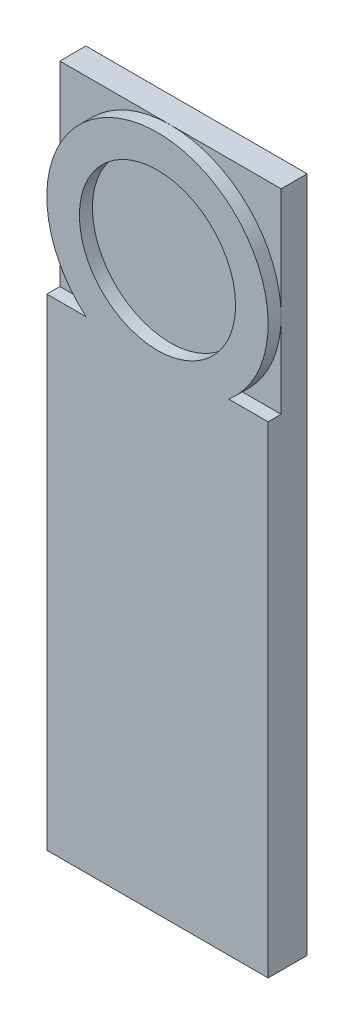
ISO-10303-21;
HEADER;
FILE_DESCRIPTION(('STEP AP214'),'2;1');
FILE_NAME('part.step','',(''),(''),'','','');
FILE_SCHEMA(('AUTOMOTIVE_DESIGN { 1 0 10303 214 1 1 1 1 }'));
ENDSEC;
DATA;
#1=APPLICATION_CONTEXT('core data for automotive mechanical design processes');
#2=APPLICATION_PROTOCOL_DEFINITION('international standard','automotive_design',2000,#1);
#3=PRODUCT_CONTEXT('',#1,'mechanical');
#4=PRODUCT('Part','Part','',(#3));
#5=PRODUCT_RELATED_PRODUCT_CATEGORY('part','',(#4));
#6=PRODUCT_DEFINITION_FORMATION('','',#4);
#7=PRODUCT_DEFINITION_CONTEXT('part definition',#1,'design');
#8=PRODUCT_DEFINITION('design','',#6,#7);
#9=PRODUCT_DEFINITION_SHAPE('','',#8);
#10=(LENGTH_UNIT() NAMED_UNIT(*) SI_UNIT(.MILLI.,.METRE.));
#11=(NAMED_UNIT(*) PLANE_ANGLE_UNIT() SI_UNIT($,.RADIAN.));
#12=(NAMED_UNIT(*) SI_UNIT($,.STERADIAN.) SOLID_ANGLE_UNIT());
#13=UNCERTAINTY_MEASURE_WITH_UNIT(LENGTH_MEASURE(1.E-05),#10,'distance_accuracy_value','');
#14=(GEOMETRIC_REPRESENTATION_CONTEXT(3) GLOBAL_UNCERTAINTY_ASSIGNED_CONTEXT((#13)) GLOBAL_UNIT_ASSIGNED_CONTEXT((#10,
#11,#12)) REPRESENTATION_CONTEXT('',''));
#15=CARTESIAN_POINT('',(0.,0.,0.));
#16=DIRECTION('',(0.,0.,1.));
#17=DIRECTION('',(1.,0.,0.));
#18=AXIS2_PLACEMENT_3D('',#15,#16,#17);
#19=CARTESIAN_POINT('',(0.,0.,4.));
#20=DIRECTION('',(0.,0.,-1.));
#21=DIRECTION('',(-1.,0.,0.));
#22=AXIS2_PLACEMENT_3D('',#19,#20,#21);
#23=CYLINDRICAL_SURFACE('',#22,12.);
#24=CARTESIAN_POINT('',(0.,0.,0.));
#25=DIRECTION('',(0.,0.,1.));
#26=DIRECTION('',(1.,0.,0.));
#27=AXIS2_PLACEMENT_3D('',#24,#25,#26);
#28=CIRCLE('',#27,12.);
#29=CARTESIAN_POINT('',(12.,0.,0.));
#30=VERTEX_POINT('',#29);
#31=EDGE_CURVE('E161',#30,#30,#28,.T.);
#32=ORIENTED_EDGE('',*,*,#31,.F.);
#33=EDGE_LOOP('',(#32));
#34=FACE_BOUND('',#33,.T.);
#35=CARTESIAN_POINT('',(0.,0.,2.));
#36=DIRECTION('',(0.,0.,1.));
#37=DIRECTION('',(1.,0.,0.));
#38=AXIS2_PLACEMENT_3D('',#35,#36,#37);
#39=CIRCLE('',#38,12.);
#40=CARTESIAN_POINT('',(12.,0.,2.));
#41=VERTEX_POINT('',#40);
#42=EDGE_CURVE('E120',#41,#41,#39,.T.);
#43=ORIENTED_EDGE('',*,*,#42,.T.);
#44=EDGE_LOOP('',(#43));
#45=FACE_BOUND('',#44,.T.);
#46=ADVANCED_FACE('F39',(#34,#45),#23,.F.);
#47=CARTESIAN_POINT('',(0.,0.,0.));
#48=DIRECTION('',(0.,0.,-1.));
#49=DIRECTION('',(-1.,0.,0.));
#50=AXIS2_PLACEMENT_3D('',#47,#48,#49);
#51=PLANE('',#50);
#52=ORIENTED_EDGE('',*,*,#31,.T.);
#53=EDGE_LOOP('',(#52));
#54=FACE_BOUND('',#53,.T.);
#55=ADVANCED_FACE('F212',(#54),#51,.F.);
#56=CARTESIAN_POINT('',(0.,0.,2.));
#57=DIRECTION('',(0.,0.,1.));
#58=DIRECTION('',(1.,0.,0.));
#59=AXIS2_PLACEMENT_3D('',#56,#57,#58);
#60=PLANE('',#59);
#61=ORIENTED_EDGE('',*,*,#42,.F.);
#62=EDGE_LOOP('',(#61));
#63=FACE_BOUND('',#62,.T.);
#64=CARTESIAN_POINT('',(0.,0.,2.));
#65=DIRECTION('',(0.,0.,1.));
#66=DIRECTION('',(1.,0.,0.));
#67=AXIS2_PLACEMENT_3D('',#64,#65,#66);
#68=CIRCLE('',#67,17.);
#69=CARTESIAN_POINT('',(10.9544511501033,-13.,2.));
#70=VERTEX_POINT('',#69);
#71=CARTESIAN_POINT('',(-10.9544511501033,-13.,2.));
#72=VERTEX_POINT('',#71);
#73=EDGE_CURVE('E112',#70,#72,#68,.T.);
#74=ORIENTED_EDGE('',*,*,#73,.T.);
#75=DIRECTION('',(-1.,0.,0.));
#76=VECTOR('',#75,1.);
#77=CARTESIAN_POINT('',(-10.9544511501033,-13.,2.));
#78=LINE('',#77,#76);
#79=CARTESIAN_POINT('',(-17.,-13.,2.));
#80=VERTEX_POINT('',#79);
#81=EDGE_CURVE('E115',#72,#80,#78,.T.);
#82=ORIENTED_EDGE('',*,*,#81,.T.);
#83=DIRECTION('',(0.,-1.,0.));
#84=VECTOR('',#83,1.);
#85=CARTESIAN_POINT('',(-17.,-13.,2.));
#86=LINE('',#85,#84);
#87=CARTESIAN_POINT('',(-17.,-87.,2.));
#88=VERTEX_POINT('',#87);
#89=EDGE_CURVE('E55',#80,#88,#86,.T.);
#90=ORIENTED_EDGE('',*,*,#89,.T.);
#91=DIRECTION('',(1.,0.,0.));
#92=VECTOR('',#91,1.);
#93=CARTESIAN_POINT('',(17.,-87.,2.));
#94=LINE('',#93,#92);
#95=CARTESIAN_POINT('',(17.,-87.,2.));
#96=VERTEX_POINT('',#95);
#97=EDGE_CURVE('E204',#88,#96,#94,.T.);
#98=ORIENTED_EDGE('',*,*,#97,.T.);
#99=DIRECTION('',(0.,1.,0.));
#100=VECTOR('',#99,1.);
#101=CARTESIAN_POINT('',(17.,-13.,2.));
#102=LINE('',#101,#100);
#103=CARTESIAN_POINT('',(17.,-13.,2.));
#104=VERTEX_POINT('',#103);
#105=EDGE_CURVE('E202',#96,#104,#102,.T.);
#106=ORIENTED_EDGE('',*,*,#105,.T.);
#107=DIRECTION('',(-1.,0.,0.));
#108=VECTOR('',#107,1.);
#109=CARTESIAN_POINT('',(10.9544511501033,-13.,2.));
#110=LINE('',#109,#108);
#111=EDGE_CURVE('E117',#104,#70,#110,.T.);
#112=ORIENTED_EDGE('',*,*,#111,.T.);
#113=EDGE_LOOP('',(#74,#82,#90,#98,#106,#112));
#114=FACE_BOUND('',#113,.T.);
#115=ADVANCED_FACE('F114',(#63,#114),#60,.T.);
#116=CARTESIAN_POINT('',(0.,0.,0.));
#117=DIRECTION('',(0.,0.,1.));
#118=DIRECTION('',(1.,0.,0.));
#119=AXIS2_PLACEMENT_3D('',#116,#117,#118);
#120=CIRCLE('',#119,17.);
#121=CARTESIAN_POINT('',(17.,0.,0.));
#122=VERTEX_POINT('',#121);
#123=CARTESIAN_POINT('',(0.,17.,0.));
#124=VERTEX_POINT('',#123);
#125=EDGE_CURVE('E11',#122,#124,#120,.T.);
#126=ORIENTED_EDGE('',*,*,#125,.F.);
#127=DIRECTION('',(0.,-1.,0.));
#128=VECTOR('',#127,1.);
#129=CARTESIAN_POINT('',(17.,0.,0.));
#130=LINE('',#129,#128);
#131=CARTESIAN_POINT('',(17.,17.,0.));
#132=VERTEX_POINT('',#131);
#133=EDGE_CURVE('E153',#132,#122,#130,.T.);
#134=ORIENTED_EDGE('',*,*,#133,.F.);
#135=DIRECTION('',(-1.,0.,0.));
#136=VECTOR('',#135,1.);
#137=CARTESIAN_POINT('',(0.,17.,0.));
#138=LINE('',#137,#136);
#139=EDGE_CURVE('E136',#132,#124,#138,.T.);
#140=ORIENTED_EDGE('',*,*,#139,.T.);
#141=EDGE_LOOP('',(#126,#134,#140));
#142=FACE_BOUND('',#141,.T.);
#143=ADVANCED_FACE('F175',(#142),#51,.F.);
#144=CARTESIAN_POINT('',(0.,17.,-4.));
#145=DIRECTION('',(0.,1.,0.));
#146=DIRECTION('',(0.,0.,1.));
#147=AXIS2_PLACEMENT_3D('',#144,#145,#146);
#148=PLANE('',#147);
#149=ORIENTED_EDGE('',*,*,#139,.F.);
#150=DIRECTION('',(0.,0.,1.));
#151=VECTOR('',#150,1.);
#152=CARTESIAN_POINT('',(17.,17.,-4.));
#153=LINE('',#152,#151);
#154=CARTESIAN_POINT('',(17.,17.,-4.));
#155=VERTEX_POINT('',#154);
#156=EDGE_CURVE('E160',#155,#132,#153,.T.);
#157=ORIENTED_EDGE('',*,*,#156,.F.);
#158=DIRECTION('',(-1.,0.,0.));
#159=VECTOR('',#158,1.);
#160=CARTESIAN_POINT('',(0.,17.,-4.));
#161=LINE('',#160,#159);
#162=CARTESIAN_POINT('',(-17.,17.,-4.));
#163=VERTEX_POINT('',#162);
#164=EDGE_CURVE('E141',#155,#163,#161,.T.);
#165=ORIENTED_EDGE('',*,*,#164,.T.);
#166=DIRECTION('',(0.,0.,1.));
#167=VECTOR('',#166,1.);
#168=CARTESIAN_POINT('',(-17.,17.,-4.));
#169=LINE('',#168,#167);
#170=CARTESIAN_POINT('',(-17.,17.,0.));
#171=VERTEX_POINT('',#170);
#172=EDGE_CURVE('E149',#163,#171,#169,.T.);
#173=ORIENTED_EDGE('',*,*,#172,.T.);
#174=EDGE_CURVE('E133',#124,#171,#138,.T.);
#175=ORIENTED_EDGE('',*,*,#174,.F.);
#176=EDGE_LOOP('',(#149,#157,#165,#173,#175));
#177=FACE_BOUND('',#176,.T.);
#178=ADVANCED_FACE('F172',(#177),#148,.T.);
#179=CARTESIAN_POINT('',(-17.,0.,0.));
#180=VERTEX_POINT('',#179);
#181=EDGE_CURVE('E47',#124,#180,#120,.T.);
#182=ORIENTED_EDGE('',*,*,#181,.F.);
#183=ORIENTED_EDGE('',*,*,#174,.T.);
#184=DIRECTION('',(0.,-1.,0.));
#185=VECTOR('',#184,1.);
#186=CARTESIAN_POINT('',(-17.,0.,0.));
#187=LINE('',#186,#185);
#188=EDGE_CURVE('E145',#171,#180,#187,.T.);
#189=ORIENTED_EDGE('',*,*,#188,.T.);
#190=EDGE_LOOP('',(#182,#183,#189));
#191=FACE_BOUND('',#190,.T.);
#192=ADVANCED_FACE('F168',(#191),#51,.F.);
#193=DIRECTION('',(-1.,0.,0.));
#194=VECTOR('',#193,1.);
#195=CARTESIAN_POINT('',(0.,-13.,0.));
#196=LINE('',#195,#194);
#197=CARTESIAN_POINT('',(-10.9544511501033,-13.,0.));
#198=VERTEX_POINT('',#197);
#199=CARTESIAN_POINT('',(-17.,-13.,0.));
#200=VERTEX_POINT('',#199);
#201=EDGE_CURVE('E189',#198,#200,#196,.T.);
#202=ORIENTED_EDGE('',*,*,#201,.F.);
#203=EDGE_CURVE('E132',#180,#198,#120,.T.);
#204=ORIENTED_EDGE('',*,*,#203,.F.);
#205=EDGE_CURVE('E155',#180,#200,#187,.T.);
#206=ORIENTED_EDGE('',*,*,#205,.T.);
#207=EDGE_LOOP('',(#202,#204,#206));
#208=FACE_BOUND('',#207,.T.);
#209=ADVANCED_FACE('F219',(#208),#51,.F.);
#210=CARTESIAN_POINT('',(17.,-13.,0.));
#211=VERTEX_POINT('',#210);
#212=CARTESIAN_POINT('',(10.9544511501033,-13.,0.));
#213=VERTEX_POINT('',#212);
#214=EDGE_CURVE('E186',#211,#213,#196,.T.);
#215=ORIENTED_EDGE('',*,*,#214,.F.);
#216=EDGE_CURVE('E152',#122,#211,#130,.T.);
#217=ORIENTED_EDGE('',*,*,#216,.F.);
#218=EDGE_CURVE('E48',#213,#122,#120,.T.);
#219=ORIENTED_EDGE('',*,*,#218,.F.);
#220=EDGE_LOOP('',(#215,#217,#219));
#221=FACE_BOUND('',#220,.T.);
#222=ADVANCED_FACE('F185',(#221),#51,.F.);
#223=CARTESIAN_POINT('',(0.,0.,-4.));
#224=DIRECTION('',(0.,0.,-1.));
#225=DIRECTION('',(-1.,0.,0.));
#226=AXIS2_PLACEMENT_3D('',#223,#224,#225);
#227=PLANE('',#226);
#228=ORIENTED_EDGE('',*,*,#164,.F.);
#229=DIRECTION('',(0.,-1.,0.));
#230=VECTOR('',#229,1.);
#231=CARTESIAN_POINT('',(17.,0.,-4.));
#232=LINE('',#231,#230);
#233=CARTESIAN_POINT('',(17.,-87.,-4.));
#234=VERTEX_POINT('',#233);
#235=EDGE_CURVE('E144',#155,#234,#232,.T.);
#236=ORIENTED_EDGE('',*,*,#235,.T.);
#237=DIRECTION('',(1.,0.,0.));
#238=VECTOR('',#237,1.);
#239=CARTESIAN_POINT('',(17.,-87.,-4.));
#240=LINE('',#239,#238);
#241=CARTESIAN_POINT('',(-17.,-87.,-4.));
#242=VERTEX_POINT('',#241);
#243=EDGE_CURVE('E198',#242,#234,#240,.T.);
#244=ORIENTED_EDGE('',*,*,#243,.F.);
#245=DIRECTION('',(0.,-1.,0.));
#246=VECTOR('',#245,1.);
#247=CARTESIAN_POINT('',(-17.,0.,-4.));
#248=LINE('',#247,#246);
#249=EDGE_CURVE('E147',#163,#242,#248,.T.);
#250=ORIENTED_EDGE('',*,*,#249,.F.);
#251=EDGE_LOOP('',(#228,#236,#244,#250));
#252=FACE_BOUND('',#251,.T.);
#253=ADVANCED_FACE('F237',(#252),#227,.T.);
#254=CARTESIAN_POINT('',(0.,-13.,0.));
#255=DIRECTION('',(0.,-1.,0.));
#256=DIRECTION('',(0.,0.,-1.));
#257=AXIS2_PLACEMENT_3D('',#254,#255,#256);
#258=PLANE('',#257);
#259=ORIENTED_EDGE('',*,*,#111,.F.);
#260=DIRECTION('',(0.,0.,1.));
#261=VECTOR('',#260,1.);
#262=CARTESIAN_POINT('',(17.,-13.,0.));
#263=LINE('',#262,#261);
#264=EDGE_CURVE('E188',#211,#104,#263,.T.);
#265=ORIENTED_EDGE('',*,*,#264,.F.);
#266=ORIENTED_EDGE('',*,*,#214,.T.);
#267=DIRECTION('',(0.,0.,-1.));
#268=VECTOR('',#267,1.);
#269=CARTESIAN_POINT('',(10.9544511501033,-13.,4.));
#270=LINE('',#269,#268);
#271=EDGE_CURVE('E134',#213,#70,#270,.F.);
#272=ORIENTED_EDGE('',*,*,#271,.T.);
#273=EDGE_LOOP('',(#259,#265,#266,#272));
#274=FACE_BOUND('',#273,.T.);
#275=ADVANCED_FACE('F240',(#274),#258,.F.);
#276=ORIENTED_EDGE('',*,*,#81,.F.);
#277=DIRECTION('',(0.,0.,-1.));
#278=VECTOR('',#277,1.);
#279=CARTESIAN_POINT('',(-10.9544511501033,-13.,4.));
#280=LINE('',#279,#278);
#281=EDGE_CURVE('E125',#72,#198,#280,.T.);
#282=ORIENTED_EDGE('',*,*,#281,.T.);
#283=ORIENTED_EDGE('',*,*,#201,.T.);
#284=DIRECTION('',(0.,0.,1.));
#285=VECTOR('',#284,1.);
#286=CARTESIAN_POINT('',(-17.,-13.,0.));
#287=LINE('',#286,#285);
#288=EDGE_CURVE('E128',#200,#80,#287,.T.);
#289=ORIENTED_EDGE('',*,*,#288,.T.);
#290=EDGE_LOOP('',(#276,#282,#283,#289));
#291=FACE_BOUND('',#290,.T.);
#292=ADVANCED_FACE('F124',(#291),#258,.F.);
#293=CARTESIAN_POINT('',(0.,-87.,0.));
#294=DIRECTION('',(0.,1.,0.));
#295=DIRECTION('',(0.,0.,1.));
#296=AXIS2_PLACEMENT_3D('',#293,#294,#295);
#297=PLANE('',#296);
#298=ORIENTED_EDGE('',*,*,#97,.F.);
#299=DIRECTION('',(0.,0.,-1.));
#300=VECTOR('',#299,1.);
#301=CARTESIAN_POINT('',(-17.,-87.,-4.));
#302=LINE('',#301,#300);
#303=EDGE_CURVE('E192',#88,#242,#302,.T.);
#304=ORIENTED_EDGE('',*,*,#303,.T.);
#305=ORIENTED_EDGE('',*,*,#243,.T.);
#306=DIRECTION('',(0.,0.,1.));
#307=VECTOR('',#306,1.);
#308=CARTESIAN_POINT('',(17.,-87.,-4.));
#309=LINE('',#308,#307);
#310=EDGE_CURVE('E195',#234,#96,#309,.T.);
#311=ORIENTED_EDGE('',*,*,#310,.T.);
#312=EDGE_LOOP('',(#298,#304,#305,#311));
#313=FACE_BOUND('',#312,.T.);
#314=ADVANCED_FACE('F232',(#313),#297,.F.);
#315=CARTESIAN_POINT('',(-17.,0.,-4.));
#316=DIRECTION('',(-1.,0.,0.));
#317=DIRECTION('',(0.,0.,1.));
#318=AXIS2_PLACEMENT_3D('',#315,#316,#317);
#319=PLANE('',#318);
#320=ORIENTED_EDGE('',*,*,#303,.F.);
#321=ORIENTED_EDGE('',*,*,#89,.F.);
#322=ORIENTED_EDGE('',*,*,#288,.F.);
#323=ORIENTED_EDGE('',*,*,#205,.F.);
#324=ORIENTED_EDGE('',*,*,#188,.F.);
#325=ORIENTED_EDGE('',*,*,#172,.F.);
#326=ORIENTED_EDGE('',*,*,#249,.T.);
#327=EDGE_LOOP('',(#320,#321,#322,#323,#324,#325,#326));
#328=FACE_BOUND('',#327,.T.);
#329=ADVANCED_FACE('F230',(#328),#319,.T.);
#330=CARTESIAN_POINT('',(17.,0.,-4.));
#331=DIRECTION('',(-1.,0.,0.));
#332=DIRECTION('',(0.,0.,1.));
#333=AXIS2_PLACEMENT_3D('',#330,#331,#332);
#334=PLANE('',#333);
#335=ORIENTED_EDGE('',*,*,#105,.F.);
#336=ORIENTED_EDGE('',*,*,#310,.F.);
#337=ORIENTED_EDGE('',*,*,#235,.F.);
#338=ORIENTED_EDGE('',*,*,#156,.T.);
#339=ORIENTED_EDGE('',*,*,#133,.T.);
#340=ORIENTED_EDGE('',*,*,#216,.T.);
#341=ORIENTED_EDGE('',*,*,#264,.T.);
#342=EDGE_LOOP('',(#335,#336,#337,#338,#339,#340,#341));
#343=FACE_BOUND('',#342,.T.);
#344=ADVANCED_FACE('F180',(#343),#334,.F.);
#345=CARTESIAN_POINT('',(0.,0.,4.));
#346=DIRECTION('',(0.,0.,-1.));
#347=DIRECTION('',(-1.,0.,0.));
#348=AXIS2_PLACEMENT_3D('',#345,#346,#347);
#349=CYLINDRICAL_SURFACE('',#348,17.);
#350=ORIENTED_EDGE('',*,*,#73,.F.);
#351=ORIENTED_EDGE('',*,*,#271,.F.);
#352=ORIENTED_EDGE('',*,*,#218,.T.);
#353=ORIENTED_EDGE('',*,*,#125,.T.);
#354=ORIENTED_EDGE('',*,*,#181,.T.);
#355=ORIENTED_EDGE('',*,*,#203,.T.);
#356=ORIENTED_EDGE('',*,*,#281,.F.);
#357=EDGE_LOOP('',(#350,#351,#352,#353,#354,#355,#356));
#358=FACE_BOUND('',#357,.T.);
#359=ADVANCED_FACE('F41',(#358),#349,.T.);
#360=CLOSED_SHELL('',(#46,#55,#115,#143,#178,#192,#209,#222,#253,#275,#292,#314,#329,#344,#359));
#361=MANIFOLD_SOLID_BREP('B2',#360);
#362=ADVANCED_BREP_SHAPE_REPRESENTATION('',(#18,#361),#14);
#363=SHAPE_DEFINITION_REPRESENTATION(#9,#362);
ENDSEC;
END-ISO-10303-21;
